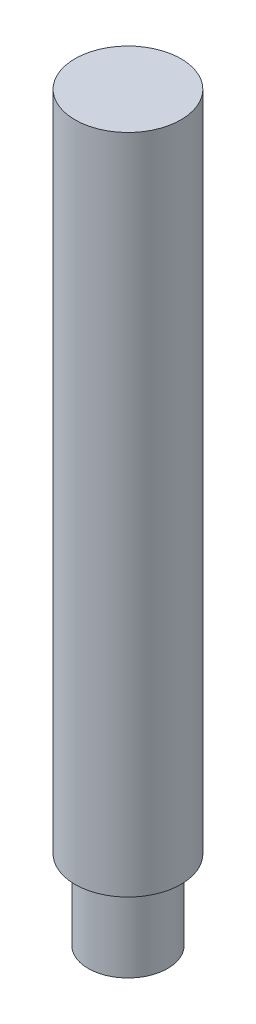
ISO-10303-21;
HEADER;
FILE_DESCRIPTION(('STEP AP214'),'2;1');
FILE_NAME('part.step','',(''),(''),'','','');
FILE_SCHEMA(('AUTOMOTIVE_DESIGN { 1 0 10303 214 1 1 1 1 }'));
ENDSEC;
DATA;
#1=APPLICATION_CONTEXT('core data for automotive mechanical design processes');
#2=APPLICATION_PROTOCOL_DEFINITION('international standard','automotive_design',2000,#1);
#3=PRODUCT_CONTEXT('',#1,'mechanical');
#4=PRODUCT('Part','Part','',(#3));
#5=PRODUCT_RELATED_PRODUCT_CATEGORY('part','',(#4));
#6=PRODUCT_DEFINITION_FORMATION('','',#4);
#7=PRODUCT_DEFINITION_CONTEXT('part definition',#1,'design');
#8=PRODUCT_DEFINITION('design','',#6,#7);
#9=PRODUCT_DEFINITION_SHAPE('','',#8);
#10=(LENGTH_UNIT() NAMED_UNIT(*) SI_UNIT(.MILLI.,.METRE.));
#11=(NAMED_UNIT(*) PLANE_ANGLE_UNIT() SI_UNIT($,.RADIAN.));
#12=(NAMED_UNIT(*) SI_UNIT($,.STERADIAN.) SOLID_ANGLE_UNIT());
#13=UNCERTAINTY_MEASURE_WITH_UNIT(LENGTH_MEASURE(1.E-05),#10,'distance_accuracy_value','');
#14=(GEOMETRIC_REPRESENTATION_CONTEXT(3) GLOBAL_UNCERTAINTY_ASSIGNED_CONTEXT((#13)) GLOBAL_UNIT_ASSIGNED_CONTEXT((#10,
#11,#12)) REPRESENTATION_CONTEXT('',''));
#15=CARTESIAN_POINT('',(0.,0.,0.));
#16=DIRECTION('',(0.,0.,1.));
#17=DIRECTION('',(1.,0.,0.));
#18=AXIS2_PLACEMENT_3D('',#15,#16,#17);
#19=CARTESIAN_POINT('',(0.,6.,0.));
#20=DIRECTION('',(0.,-1.,0.));
#21=DIRECTION('',(0.,0.,-1.));
#22=AXIS2_PLACEMENT_3D('',#19,#20,#21);
#23=CYLINDRICAL_SURFACE('',#22,3.);
#24=CARTESIAN_POINT('',(0.,6.,0.));
#25=DIRECTION('',(0.,1.,0.));
#26=DIRECTION('',(0.,0.,1.));
#27=AXIS2_PLACEMENT_3D('',#24,#25,#26);
#28=CIRCLE('',#27,3.);
#29=CARTESIAN_POINT('',(0.,6.,3.));
#30=VERTEX_POINT('',#29);
#31=EDGE_CURVE('E10',#30,#30,#28,.T.);
#32=ORIENTED_EDGE('',*,*,#31,.F.);
#33=EDGE_LOOP('',(#32));
#34=FACE_BOUND('',#33,.T.);
#35=CARTESIAN_POINT('',(0.,0.,0.));
#36=DIRECTION('',(0.,1.,0.));
#37=DIRECTION('',(0.,0.,1.));
#38=AXIS2_PLACEMENT_3D('',#35,#36,#37);
#39=CIRCLE('',#38,3.);
#40=CARTESIAN_POINT('',(0.,0.,3.));
#41=VERTEX_POINT('',#40);
#42=EDGE_CURVE('E34',#41,#41,#39,.T.);
#43=ORIENTED_EDGE('',*,*,#42,.T.);
#44=EDGE_LOOP('',(#43));
#45=FACE_BOUND('',#44,.T.);
#46=ADVANCED_FACE('F31',(#34,#45),#23,.T.);
#47=CARTESIAN_POINT('',(0.,0.,0.));
#48=DIRECTION('',(0.,1.,0.));
#49=DIRECTION('',(0.,0.,1.));
#50=AXIS2_PLACEMENT_3D('',#47,#48,#49);
#51=PLANE('',#50);
#52=ORIENTED_EDGE('',*,*,#42,.F.);
#53=EDGE_LOOP('',(#52));
#54=FACE_BOUND('',#53,.T.);
#55=ADVANCED_FACE('F59',(#54),#51,.F.);
#56=CARTESIAN_POINT('',(0.,6.,0.));
#57=DIRECTION('',(0.,1.,0.));
#58=DIRECTION('',(0.,0.,1.));
#59=AXIS2_PLACEMENT_3D('',#56,#57,#58);
#60=PLANE('',#59);
#61=CARTESIAN_POINT('',(0.,6.,0.));
#62=DIRECTION('',(0.,1.,0.));
#63=DIRECTION('',(0.,0.,1.));
#64=AXIS2_PLACEMENT_3D('',#61,#62,#63);
#65=CIRCLE('',#64,4.);
#66=CARTESIAN_POINT('',(0.,6.,4.));
#67=VERTEX_POINT('',#66);
#68=EDGE_CURVE('E43',#67,#67,#65,.T.);
#69=ORIENTED_EDGE('',*,*,#68,.F.);
#70=EDGE_LOOP('',(#69));
#71=FACE_BOUND('',#70,.T.);
#72=ORIENTED_EDGE('',*,*,#31,.T.);
#73=EDGE_LOOP('',(#72));
#74=FACE_BOUND('',#73,.T.);
#75=ADVANCED_FACE('F54',(#71,#74),#60,.F.);
#76=CARTESIAN_POINT('',(0.,56.,0.));
#77=DIRECTION('',(0.,-1.,0.));
#78=DIRECTION('',(0.,0.,-1.));
#79=AXIS2_PLACEMENT_3D('',#76,#77,#78);
#80=CYLINDRICAL_SURFACE('',#79,4.);
#81=CARTESIAN_POINT('',(0.,56.,0.));
#82=DIRECTION('',(0.,1.,0.));
#83=DIRECTION('',(0.,0.,1.));
#84=AXIS2_PLACEMENT_3D('',#81,#82,#83);
#85=CIRCLE('',#84,4.);
#86=CARTESIAN_POINT('',(0.,56.,4.));
#87=VERTEX_POINT('',#86);
#88=EDGE_CURVE('E41',#87,#87,#85,.T.);
#89=ORIENTED_EDGE('',*,*,#88,.F.);
#90=EDGE_LOOP('',(#89));
#91=FACE_BOUND('',#90,.T.);
#92=ORIENTED_EDGE('',*,*,#68,.T.);
#93=EDGE_LOOP('',(#92));
#94=FACE_BOUND('',#93,.T.);
#95=ADVANCED_FACE('F51',(#91,#94),#80,.T.);
#96=CARTESIAN_POINT('',(0.,56.,0.));
#97=DIRECTION('',(0.,1.,0.));
#98=DIRECTION('',(0.,0.,1.));
#99=AXIS2_PLACEMENT_3D('',#96,#97,#98);
#100=PLANE('',#99);
#101=ORIENTED_EDGE('',*,*,#88,.T.);
#102=EDGE_LOOP('',(#101));
#103=FACE_BOUND('',#102,.T.);
#104=ADVANCED_FACE('F49',(#103),#100,.T.);
#105=CLOSED_SHELL('',(#46,#55,#75,#95,#104));
#106=MANIFOLD_SOLID_BREP('B2',#105);
#107=ADVANCED_BREP_SHAPE_REPRESENTATION('',(#18,#106),#14);
#108=SHAPE_DEFINITION_REPRESENTATION(#9,#107);
ENDSEC;
END-ISO-10303-21;
